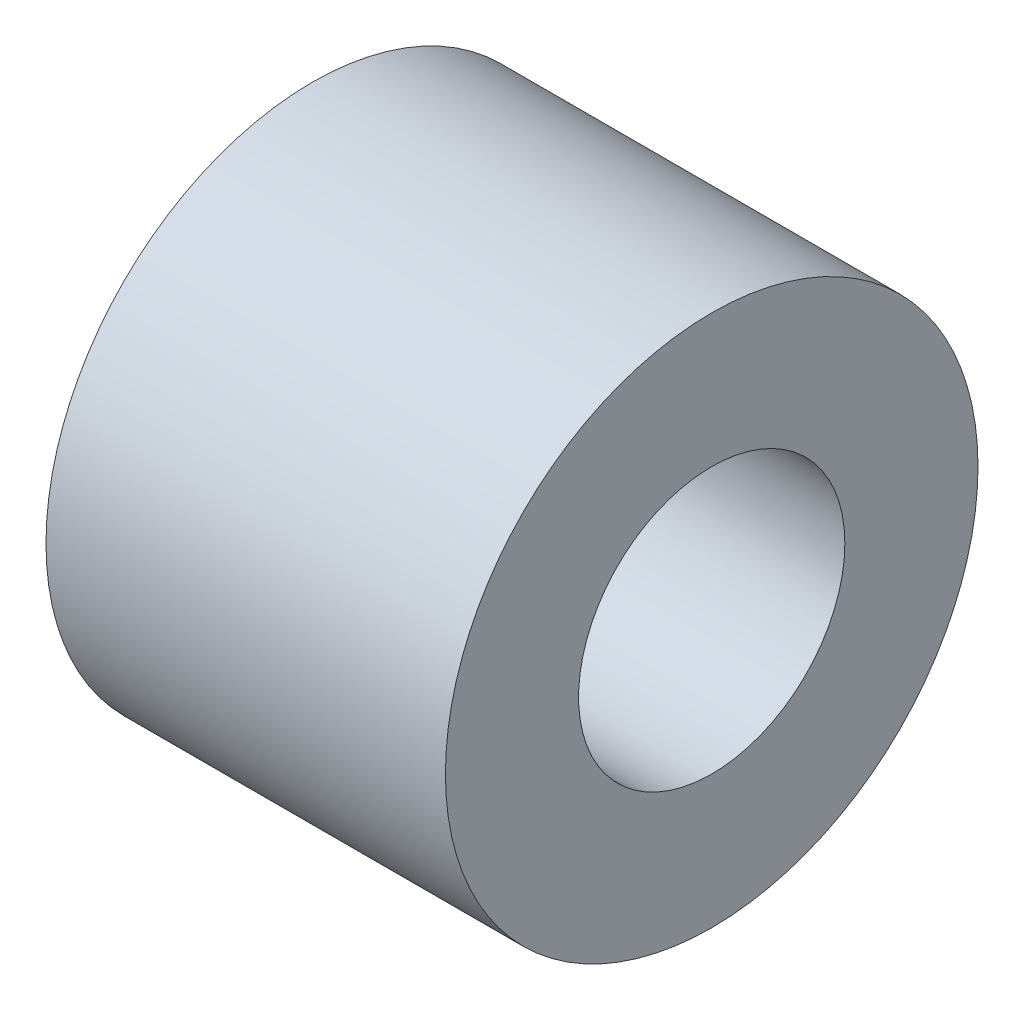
ISO-10303-21;
HEADER;
FILE_DESCRIPTION(('STEP AP214'),'2;1');
FILE_NAME('part.step','',(''),(''),'','','');
FILE_SCHEMA(('AUTOMOTIVE_DESIGN { 1 0 10303 214 1 1 1 1 }'));
ENDSEC;
DATA;
#1=APPLICATION_CONTEXT('core data for automotive mechanical design processes');
#2=APPLICATION_PROTOCOL_DEFINITION('international standard','automotive_design',2000,#1);
#3=PRODUCT_CONTEXT('',#1,'mechanical');
#4=PRODUCT('Part','Part','',(#3));
#5=PRODUCT_RELATED_PRODUCT_CATEGORY('part','',(#4));
#6=PRODUCT_DEFINITION_FORMATION('','',#4);
#7=PRODUCT_DEFINITION_CONTEXT('part definition',#1,'design');
#8=PRODUCT_DEFINITION('design','',#6,#7);
#9=PRODUCT_DEFINITION_SHAPE('','',#8);
#10=(LENGTH_UNIT() NAMED_UNIT(*) SI_UNIT(.MILLI.,.METRE.));
#11=(NAMED_UNIT(*) PLANE_ANGLE_UNIT() SI_UNIT($,.RADIAN.));
#12=(NAMED_UNIT(*) SI_UNIT($,.STERADIAN.) SOLID_ANGLE_UNIT());
#13=UNCERTAINTY_MEASURE_WITH_UNIT(LENGTH_MEASURE(1.E-05),#10,'distance_accuracy_value','');
#14=(GEOMETRIC_REPRESENTATION_CONTEXT(3) GLOBAL_UNCERTAINTY_ASSIGNED_CONTEXT((#13)) GLOBAL_UNIT_ASSIGNED_CONTEXT((#10,
#11,#12)) REPRESENTATION_CONTEXT('',''));
#15=CARTESIAN_POINT('',(0.,0.,0.));
#16=DIRECTION('',(0.,0.,1.));
#17=DIRECTION('',(1.,0.,0.));
#18=AXIS2_PLACEMENT_3D('',#15,#16,#17);
#19=CARTESIAN_POINT('',(3.,-1.3417902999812,0.));
#20=DIRECTION('',(1.,0.,0.));
#21=DIRECTION('',(0.,0.,-1.));
#22=AXIS2_PLACEMENT_3D('',#19,#20,#21);
#23=PLANE('',#22);
#24=CARTESIAN_POINT('',(3.,-1.3417902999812,0.));
#25=DIRECTION('',(1.,0.,0.));
#26=DIRECTION('',(0.,0.,-1.));
#27=AXIS2_PLACEMENT_3D('',#24,#25,#26);
#28=CIRCLE('',#27,2.);
#29=CARTESIAN_POINT('',(3.,-1.3417902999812,-2.));
#30=VERTEX_POINT('',#29);
#31=EDGE_CURVE('E10',#30,#30,#28,.T.);
#32=ORIENTED_EDGE('',*,*,#31,.T.);
#33=EDGE_LOOP('',(#32));
#34=FACE_BOUND('',#33,.T.);
#35=CARTESIAN_POINT('',(3.,-1.3417902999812,0.));
#36=DIRECTION('',(1.,0.,0.));
#37=DIRECTION('',(0.,0.,-1.));
#38=AXIS2_PLACEMENT_3D('',#35,#36,#37);
#39=CIRCLE('',#38,1.);
#40=CARTESIAN_POINT('',(3.,-1.3417902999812,-1.));
#41=VERTEX_POINT('',#40);
#42=EDGE_CURVE('E49',#41,#41,#39,.T.);
#43=ORIENTED_EDGE('',*,*,#42,.F.);
#44=EDGE_LOOP('',(#43));
#45=FACE_BOUND('',#44,.T.);
#46=ADVANCED_FACE('F36',(#34,#45),#23,.T.);
#47=CARTESIAN_POINT('',(0.,-1.3417902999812,0.));
#48=DIRECTION('',(1.,0.,0.));
#49=DIRECTION('',(0.,0.,-1.));
#50=AXIS2_PLACEMENT_3D('',#47,#48,#49);
#51=PLANE('',#50);
#52=CARTESIAN_POINT('',(0.,-1.3417902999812,0.));
#53=DIRECTION('',(1.,0.,0.));
#54=DIRECTION('',(0.,0.,-1.));
#55=AXIS2_PLACEMENT_3D('',#52,#53,#54);
#56=CIRCLE('',#55,2.);
#57=CARTESIAN_POINT('',(0.,-1.3417902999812,-2.));
#58=VERTEX_POINT('',#57);
#59=EDGE_CURVE('E40',#58,#58,#56,.T.);
#60=ORIENTED_EDGE('',*,*,#59,.F.);
#61=EDGE_LOOP('',(#60));
#62=FACE_BOUND('',#61,.T.);
#63=CARTESIAN_POINT('',(0.,-1.3417902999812,0.));
#64=DIRECTION('',(1.,0.,0.));
#65=DIRECTION('',(0.,0.,-1.));
#66=AXIS2_PLACEMENT_3D('',#63,#64,#65);
#67=CIRCLE('',#66,1.);
#68=CARTESIAN_POINT('',(0.,-1.3417902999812,-1.));
#69=VERTEX_POINT('',#68);
#70=EDGE_CURVE('E51',#69,#69,#67,.T.);
#71=ORIENTED_EDGE('',*,*,#70,.T.);
#72=EDGE_LOOP('',(#71));
#73=FACE_BOUND('',#72,.T.);
#74=ADVANCED_FACE('F63',(#62,#73),#51,.F.);
#75=CARTESIAN_POINT('',(3.,-1.3417902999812,0.));
#76=DIRECTION('',(-1.,0.,0.));
#77=DIRECTION('',(0.,0.,1.));
#78=AXIS2_PLACEMENT_3D('',#75,#76,#77);
#79=CYLINDRICAL_SURFACE('',#78,2.);
#80=ORIENTED_EDGE('',*,*,#31,.F.);
#81=EDGE_LOOP('',(#80));
#82=FACE_BOUND('',#81,.T.);
#83=ORIENTED_EDGE('',*,*,#59,.T.);
#84=EDGE_LOOP('',(#83));
#85=FACE_BOUND('',#84,.T.);
#86=ADVANCED_FACE('F38',(#82,#85),#79,.T.);
#87=CARTESIAN_POINT('',(3.,-1.3417902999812,0.));
#88=DIRECTION('',(-1.,0.,0.));
#89=DIRECTION('',(0.,0.,1.));
#90=AXIS2_PLACEMENT_3D('',#87,#88,#89);
#91=CYLINDRICAL_SURFACE('',#90,1.);
#92=ORIENTED_EDGE('',*,*,#42,.T.);
#93=EDGE_LOOP('',(#92));
#94=FACE_BOUND('',#93,.T.);
#95=ORIENTED_EDGE('',*,*,#70,.F.);
#96=EDGE_LOOP('',(#95));
#97=FACE_BOUND('',#96,.T.);
#98=ADVANCED_FACE('F59',(#94,#97),#91,.F.);
#99=CLOSED_SHELL('',(#46,#74,#86,#98));
#100=MANIFOLD_SOLID_BREP('B2',#99);
#101=ADVANCED_BREP_SHAPE_REPRESENTATION('',(#18,#100),#14);
#102=SHAPE_DEFINITION_REPRESENTATION(#9,#101);
ENDSEC;
END-ISO-10303-21;
